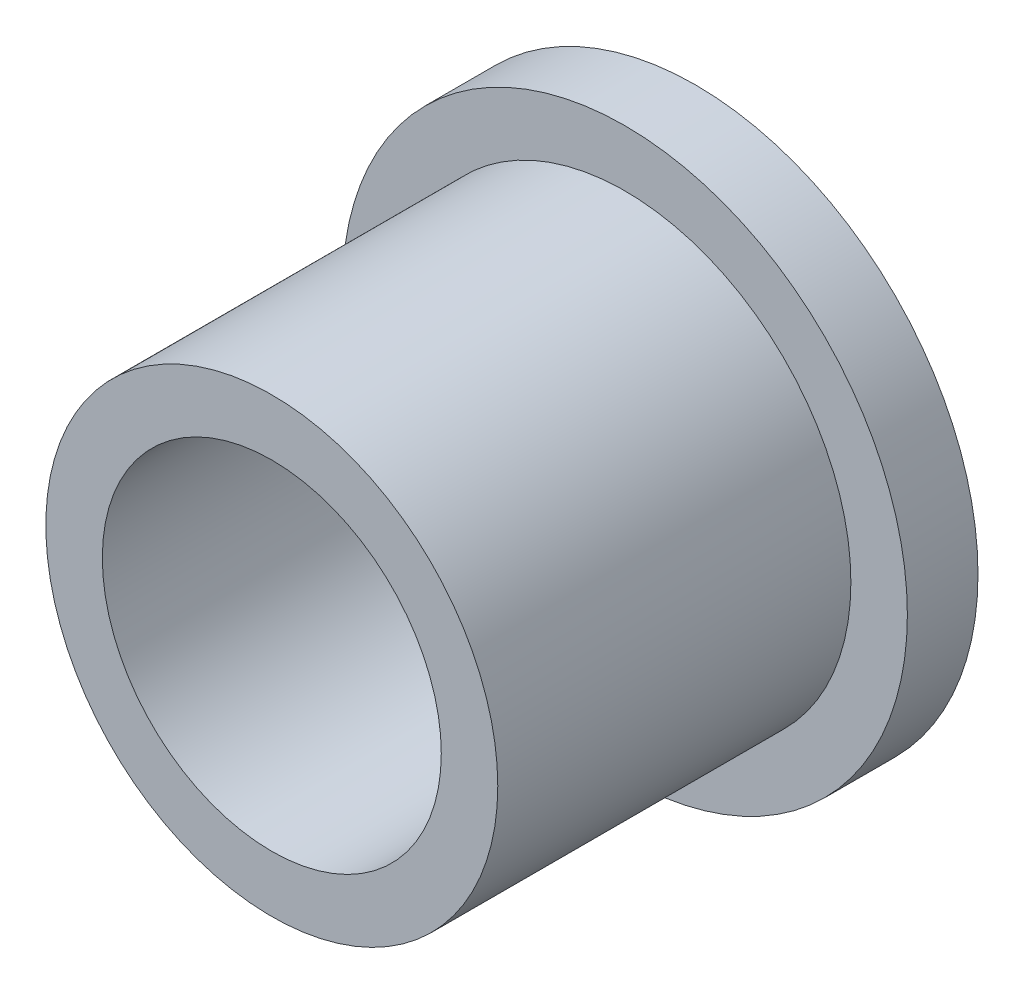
ISO-10303-21;
HEADER;
FILE_DESCRIPTION(('STEP AP214'),'2;1');
FILE_NAME('part.step','',(''),(''),'','','');
FILE_SCHEMA(('AUTOMOTIVE_DESIGN { 1 0 10303 214 1 1 1 1 }'));
ENDSEC;
DATA;
#1=APPLICATION_CONTEXT('core data for automotive mechanical design processes');
#2=APPLICATION_PROTOCOL_DEFINITION('international standard','automotive_design',2000,#1);
#3=PRODUCT_CONTEXT('',#1,'mechanical');
#4=PRODUCT('Part','Part','',(#3));
#5=PRODUCT_RELATED_PRODUCT_CATEGORY('part','',(#4));
#6=PRODUCT_DEFINITION_FORMATION('','',#4);
#7=PRODUCT_DEFINITION_CONTEXT('part definition',#1,'design');
#8=PRODUCT_DEFINITION('design','',#6,#7);
#9=PRODUCT_DEFINITION_SHAPE('','',#8);
#10=(LENGTH_UNIT() NAMED_UNIT(*) SI_UNIT(.MILLI.,.METRE.));
#11=(NAMED_UNIT(*) PLANE_ANGLE_UNIT() SI_UNIT($,.RADIAN.));
#12=(NAMED_UNIT(*) SI_UNIT($,.STERADIAN.) SOLID_ANGLE_UNIT());
#13=UNCERTAINTY_MEASURE_WITH_UNIT(LENGTH_MEASURE(1.E-05),#10,'distance_accuracy_value','');
#14=(GEOMETRIC_REPRESENTATION_CONTEXT(3) GLOBAL_UNCERTAINTY_ASSIGNED_CONTEXT((#13)) GLOBAL_UNIT_ASSIGNED_CONTEXT((#10,
#11,#12)) REPRESENTATION_CONTEXT('',''));
#15=CARTESIAN_POINT('',(0.,0.,0.));
#16=DIRECTION('',(0.,0.,1.));
#17=DIRECTION('',(1.,0.,0.));
#18=AXIS2_PLACEMENT_3D('',#15,#16,#17);
#19=CARTESIAN_POINT('',(0.,0.,5.));
#20=DIRECTION('',(0.,0.,1.));
#21=DIRECTION('',(1.,0.,0.));
#22=AXIS2_PLACEMENT_3D('',#19,#20,#21);
#23=PLANE('',#22);
#24=CARTESIAN_POINT('',(0.,0.,5.));
#25=DIRECTION('',(0.,0.,1.));
#26=DIRECTION('',(1.,0.,0.));
#27=AXIS2_PLACEMENT_3D('',#24,#25,#26);
#28=CIRCLE('',#27,20.);
#29=CARTESIAN_POINT('',(20.,0.,5.));
#30=VERTEX_POINT('',#29);
#31=EDGE_CURVE('E10',#30,#30,#28,.T.);
#32=ORIENTED_EDGE('',*,*,#31,.T.);
#33=EDGE_LOOP('',(#32));
#34=FACE_BOUND('',#33,.T.);
#35=CARTESIAN_POINT('',(0.,0.,5.));
#36=DIRECTION('',(0.,0.,1.));
#37=DIRECTION('',(1.,0.,0.));
#38=AXIS2_PLACEMENT_3D('',#35,#36,#37);
#39=CIRCLE('',#38,16.);
#40=CARTESIAN_POINT('',(16.,0.,5.));
#41=VERTEX_POINT('',#40);
#42=EDGE_CURVE('E44',#41,#41,#39,.T.);
#43=ORIENTED_EDGE('',*,*,#42,.F.);
#44=EDGE_LOOP('',(#43));
#45=FACE_BOUND('',#44,.T.);
#46=ADVANCED_FACE('F29',(#34,#45),#23,.T.);
#47=CARTESIAN_POINT('',(0.,0.,5.));
#48=DIRECTION('',(0.,0.,-1.));
#49=DIRECTION('',(-1.,0.,0.));
#50=AXIS2_PLACEMENT_3D('',#47,#48,#49);
#51=CYLINDRICAL_SURFACE('',#50,20.);
#52=ORIENTED_EDGE('',*,*,#31,.F.);
#53=EDGE_LOOP('',(#52));
#54=FACE_BOUND('',#53,.T.);
#55=CARTESIAN_POINT('',(0.,0.,0.));
#56=DIRECTION('',(0.,0.,1.));
#57=DIRECTION('',(1.,0.,0.));
#58=AXIS2_PLACEMENT_3D('',#55,#56,#57);
#59=CIRCLE('',#58,20.);
#60=CARTESIAN_POINT('',(20.,0.,0.));
#61=VERTEX_POINT('',#60);
#62=EDGE_CURVE('E36',#61,#61,#59,.T.);
#63=ORIENTED_EDGE('',*,*,#62,.T.);
#64=EDGE_LOOP('',(#63));
#65=FACE_BOUND('',#64,.T.);
#66=ADVANCED_FACE('F31',(#54,#65),#51,.T.);
#67=CARTESIAN_POINT('',(0.,0.,0.));
#68=DIRECTION('',(0.,0.,1.));
#69=DIRECTION('',(1.,0.,0.));
#70=AXIS2_PLACEMENT_3D('',#67,#68,#69);
#71=PLANE('',#70);
#72=CARTESIAN_POINT('',(0.,0.,0.));
#73=DIRECTION('',(0.,0.,-1.));
#74=DIRECTION('',(-1.,0.,0.));
#75=AXIS2_PLACEMENT_3D('',#72,#73,#74);
#76=CIRCLE('',#75,12.);
#77=CARTESIAN_POINT('',(-12.,0.,0.));
#78=VERTEX_POINT('',#77);
#79=EDGE_CURVE('E52',#78,#78,#76,.T.);
#80=ORIENTED_EDGE('',*,*,#79,.F.);
#81=EDGE_LOOP('',(#80));
#82=FACE_BOUND('',#81,.T.);
#83=ORIENTED_EDGE('',*,*,#62,.F.);
#84=EDGE_LOOP('',(#83));
#85=FACE_BOUND('',#84,.T.);
#86=ADVANCED_FACE('F58',(#82,#85),#71,.F.);
#87=CARTESIAN_POINT('',(0.,0.,30.));
#88=DIRECTION('',(0.,0.,-1.));
#89=DIRECTION('',(-1.,0.,0.));
#90=AXIS2_PLACEMENT_3D('',#87,#88,#89);
#91=CYLINDRICAL_SURFACE('',#90,16.);
#92=CARTESIAN_POINT('',(0.,0.,30.));
#93=DIRECTION('',(0.,0.,1.));
#94=DIRECTION('',(1.,0.,0.));
#95=AXIS2_PLACEMENT_3D('',#92,#93,#94);
#96=CIRCLE('',#95,16.);
#97=CARTESIAN_POINT('',(16.,0.,30.));
#98=VERTEX_POINT('',#97);
#99=EDGE_CURVE('E40',#98,#98,#96,.T.);
#100=ORIENTED_EDGE('',*,*,#99,.F.);
#101=EDGE_LOOP('',(#100));
#102=FACE_BOUND('',#101,.T.);
#103=ORIENTED_EDGE('',*,*,#42,.T.);
#104=EDGE_LOOP('',(#103));
#105=FACE_BOUND('',#104,.T.);
#106=ADVANCED_FACE('F61',(#102,#105),#91,.T.);
#107=CARTESIAN_POINT('',(0.,0.,30.));
#108=DIRECTION('',(0.,0.,1.));
#109=DIRECTION('',(1.,0.,0.));
#110=AXIS2_PLACEMENT_3D('',#107,#108,#109);
#111=PLANE('',#110);
#112=CARTESIAN_POINT('',(0.,0.,30.));
#113=DIRECTION('',(0.,0.,-1.));
#114=DIRECTION('',(-1.,0.,0.));
#115=AXIS2_PLACEMENT_3D('',#112,#113,#114);
#116=CIRCLE('',#115,12.);
#117=CARTESIAN_POINT('',(-12.,0.,30.));
#118=VERTEX_POINT('',#117);
#119=EDGE_CURVE('E49',#118,#118,#116,.T.);
#120=ORIENTED_EDGE('',*,*,#119,.T.);
#121=EDGE_LOOP('',(#120));
#122=FACE_BOUND('',#121,.T.);
#123=ORIENTED_EDGE('',*,*,#99,.T.);
#124=EDGE_LOOP('',(#123));
#125=FACE_BOUND('',#124,.T.);
#126=ADVANCED_FACE('F67',(#122,#125),#111,.T.);
#127=CARTESIAN_POINT('',(0.,0.,30.));
#128=DIRECTION('',(0.,0.,-1.));
#129=DIRECTION('',(-1.,0.,0.));
#130=AXIS2_PLACEMENT_3D('',#127,#128,#129);
#131=CYLINDRICAL_SURFACE('',#130,12.);
#132=CARTESIAN_POINT('',(-12.,0.,30.));
#133=CARTESIAN_POINT('',(-12.,0.,29.6875));
#134=CARTESIAN_POINT('',(-12.,0.,29.375));
#135=CARTESIAN_POINT('',(-12.,0.,28.75));
#136=CARTESIAN_POINT('',(-12.,0.,28.4375));
#137=CARTESIAN_POINT('',(-12.,0.,27.8125));
#138=CARTESIAN_POINT('',(-12.,0.,27.5));
#139=CARTESIAN_POINT('',(-12.,0.,26.875));
#140=CARTESIAN_POINT('',(-12.,0.,26.5625));
#141=CARTESIAN_POINT('',(-12.,0.,25.9375));
#142=CARTESIAN_POINT('',(-12.,0.,25.625));
#143=CARTESIAN_POINT('',(-12.,0.,25.));
#144=CARTESIAN_POINT('',(-12.,0.,24.6875));
#145=CARTESIAN_POINT('',(-12.,0.,24.0625));
#146=CARTESIAN_POINT('',(-12.,0.,23.75));
#147=CARTESIAN_POINT('',(-12.,0.,23.125));
#148=CARTESIAN_POINT('',(-12.,0.,22.8125));
#149=CARTESIAN_POINT('',(-12.,0.,22.1875));
#150=CARTESIAN_POINT('',(-12.,0.,21.875));
#151=CARTESIAN_POINT('',(-12.,0.,21.25));
#152=CARTESIAN_POINT('',(-12.,0.,20.9375));
#153=CARTESIAN_POINT('',(-12.,0.,20.3125));
#154=CARTESIAN_POINT('',(-12.,0.,20.));
#155=CARTESIAN_POINT('',(-12.,0.,19.375));
#156=CARTESIAN_POINT('',(-12.,0.,19.0625));
#157=CARTESIAN_POINT('',(-12.,0.,18.4375));
#158=CARTESIAN_POINT('',(-12.,0.,18.125));
#159=CARTESIAN_POINT('',(-12.,0.,17.5));
#160=CARTESIAN_POINT('',(-12.,0.,17.1875));
#161=CARTESIAN_POINT('',(-12.,0.,16.5625));
#162=CARTESIAN_POINT('',(-12.,0.,16.25));
#163=CARTESIAN_POINT('',(-12.,0.,15.625));
#164=CARTESIAN_POINT('',(-12.,0.,15.3125));
#165=CARTESIAN_POINT('',(-12.,0.,14.6875));
#166=CARTESIAN_POINT('',(-12.,0.,14.375));
#167=CARTESIAN_POINT('',(-12.,0.,13.75));
#168=CARTESIAN_POINT('',(-12.,0.,13.4375));
#169=CARTESIAN_POINT('',(-12.,0.,12.8125));
#170=CARTESIAN_POINT('',(-12.,0.,12.5));
#171=CARTESIAN_POINT('',(-12.,0.,11.875));
#172=CARTESIAN_POINT('',(-12.,0.,11.5625));
#173=CARTESIAN_POINT('',(-12.,0.,10.9375));
#174=CARTESIAN_POINT('',(-12.,0.,10.625));
#175=CARTESIAN_POINT('',(-12.,0.,10.));
#176=CARTESIAN_POINT('',(-12.,0.,9.6875));
#177=CARTESIAN_POINT('',(-12.,0.,9.0625));
#178=CARTESIAN_POINT('',(-12.,0.,8.75));
#179=CARTESIAN_POINT('',(-12.,0.,8.125));
#180=CARTESIAN_POINT('',(-12.,0.,7.8125));
#181=CARTESIAN_POINT('',(-12.,0.,7.1875));
#182=CARTESIAN_POINT('',(-12.,0.,6.875));
#183=CARTESIAN_POINT('',(-12.,0.,6.25));
#184=CARTESIAN_POINT('',(-12.,0.,5.9375));
#185=CARTESIAN_POINT('',(-12.,0.,5.3125));
#186=CARTESIAN_POINT('',(-12.,0.,5.));
#187=CARTESIAN_POINT('',(-12.,0.,4.375));
#188=CARTESIAN_POINT('',(-12.,0.,4.0625));
#189=CARTESIAN_POINT('',(-12.,0.,3.4375));
#190=CARTESIAN_POINT('',(-12.,0.,3.125));
#191=CARTESIAN_POINT('',(-12.,0.,2.5));
#192=CARTESIAN_POINT('',(-12.,0.,2.1875));
#193=CARTESIAN_POINT('',(-12.,0.,1.5625));
#194=CARTESIAN_POINT('',(-12.,0.,1.25));
#195=CARTESIAN_POINT('',(-12.,0.,0.625000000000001));
#196=CARTESIAN_POINT('',(-12.,0.,0.3125));
#197=CARTESIAN_POINT('',(-12.,0.,0.));
#198=B_SPLINE_CURVE_WITH_KNOTS('',3,(#132,#133,#134,#135,#136,#137,#138,#139,#140,#141,#142,
#143,#144,#145,#146,#147,#148,#149,#150,#151,#152,#153,#154,#155,#156,#157,#158,#159,#160,#161,
#162,#163,#164,#165,#166,#167,#168,#169,#170,#171,#172,#173,#174,#175,#176,#177,#178,#179,#180,
#181,#182,#183,#184,#185,#186,#187,#188,#189,#190,#191,#192,#193,#194,#195,#196,#197),
.UNSPECIFIED.,.F.,.F.,(4,2,2,2,2,2,2,2,2,2,2,2,2,2,2,2,2,2,2,2,2,2,2,2,2,2,2,2,2,2,2,2,4),(0.,
0.937499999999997,1.875,2.8125,3.75,4.6875,5.625,6.5625,7.5,8.4375,9.375,10.3125,11.25,12.1875,
13.125,14.0625,15.,15.9375,16.875,17.8125,18.75,19.6875,20.625,21.5625,22.5,23.4375,24.375,
25.3125,26.25,27.1875,28.125,29.0625,30.),.UNSPECIFIED.);
#199=EDGE_CURVE('BSEAM56',#118,#78,#198,.T.);
#200=ORIENTED_EDGE('',*,*,#119,.F.);
#201=ORIENTED_EDGE('',*,*,#79,.T.);
#202=ORIENTED_EDGE('',*,*,#199,.T.);
#203=ORIENTED_EDGE('',*,*,#199,.F.);
#204=EDGE_LOOP('',(#200,#202,#201,#203));
#205=FACE_BOUND('',#204,.T.);
#206=ADVANCED_FACE('F56',(#205),#131,.F.);
#207=CLOSED_SHELL('',(#46,#66,#86,#106,#126,#206));
#208=MANIFOLD_SOLID_BREP('B2',#207);
#209=ADVANCED_BREP_SHAPE_REPRESENTATION('',(#18,#208),#14);
#210=SHAPE_DEFINITION_REPRESENTATION(#9,#209);
ENDSEC;
END-ISO-10303-21;
